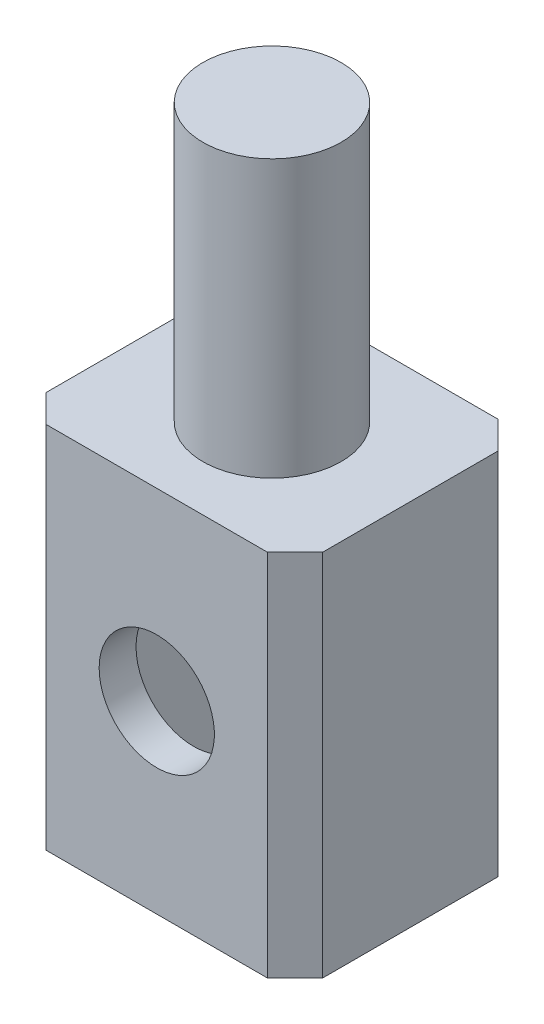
from build123d import *

# Parameters (mm, degrees)
SKETCH1_W               = 76.2
SKETCH1_H               = 63.5
BOSS_EXTRUDE1_DEPTH     = 101.6
SHELL3_T                = -10.16
SKETCH2_R               = 19.05
BOSS_EXTRUDE2_DEPTH     = 76.2
CHAMFER2_SIZE           = 7.62
CUT_EXTRUDE1_DEPTH      = 204.596488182
CUT_EXTRUDE1_DEPTH_BACK = 19.05
SKETCH3_R               = 15.875


with BuildPart() as part:
    # Sketch1 → Boss-Extrude1 (new body)
    with BuildSketch(Plane(origin=(0, 0, 0), x_dir=(1, 0, 0), z_dir=(0, 1, 0))):
        with Locations((38.1, 31.75)):
            Rectangle(SKETCH1_W, SKETCH1_H)
    extrude(amount=BOSS_EXTRUDE1_DEPTH)

    # Shell3
    shell3_openings = [part.faces().sort_by_distance(p)[0] for p in [
        (38.1, 0, -31.75),
    ]]
    offset(amount=SHELL3_T, openings=shell3_openings, kind=Kind.INTERSECTION)

    # Sketch2 → Boss-Extrude2 (add)
    with BuildSketch(Plane(origin=(0, 101.6, 0), x_dir=(1, 0, 0), z_dir=(0, 1, 0))):
        with Locations(Location((38.1, 31.75, 0), (0, 0, 90))):
            Circle(SKETCH2_R)
    extrude(amount=BOSS_EXTRUDE2_DEPTH)

    # Chamfer2
    chamfer2_edges = [part.edges().sort_by_distance(p)[0] for p in [
        (0, 50.8, -63.5),
        (76.2, 50.8, -63.5),
        (76.2, 50.8, 0),
        (0, 50.8, 0),
    ]]
    chamfer(chamfer2_edges, length=CHAMFER2_SIZE)

    # Sketch3 → Cut-Extrude1 (cut, two sides: drawn at the far end of the back side and taken through both)
    with BuildSketch(Plane.XY.offset(-CUT_EXTRUDE1_DEPTH_BACK)):
        with Locations(Location((38.1, 50.8, 0), (0, 0, 180))):
            Circle(SKETCH3_R)
    extrude(amount=CUT_EXTRUDE1_DEPTH + CUT_EXTRUDE1_DEPTH_BACK, mode=Mode.SUBTRACT)


solid = part.part
